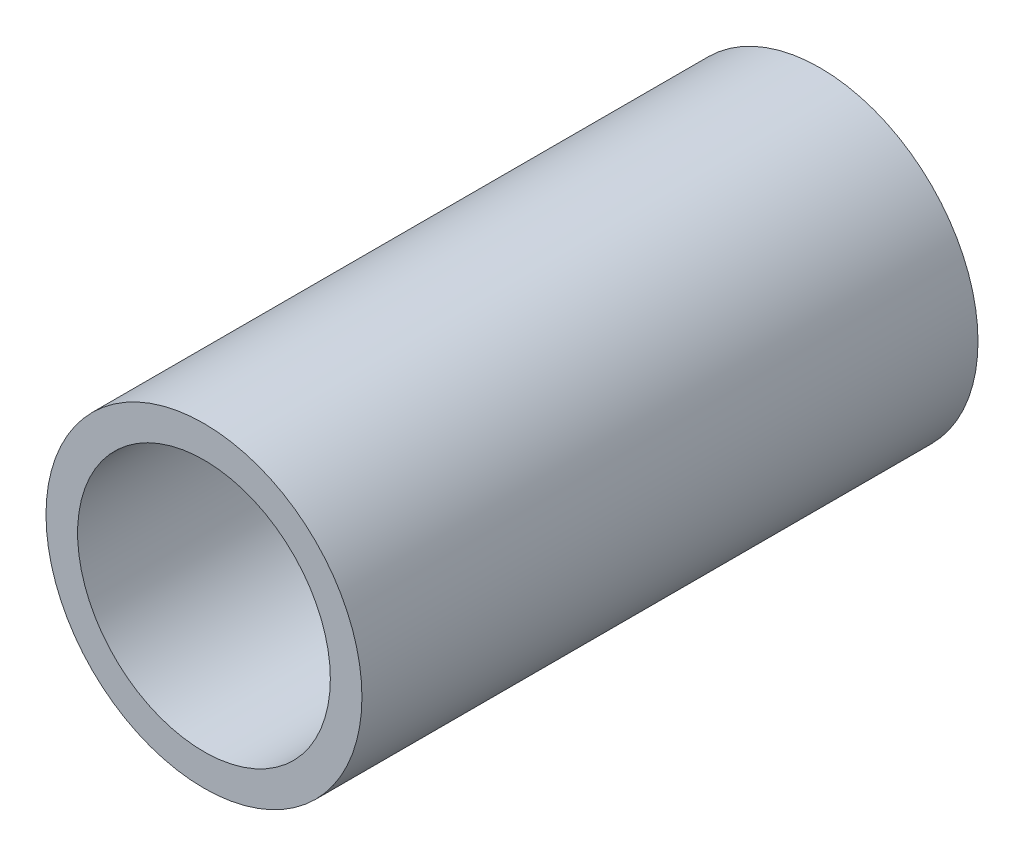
ISO-10303-21;
HEADER;
FILE_DESCRIPTION(('STEP AP214'),'2;1');
FILE_NAME('part.step','',(''),(''),'','','');
FILE_SCHEMA(('AUTOMOTIVE_DESIGN { 1 0 10303 214 1 1 1 1 }'));
ENDSEC;
DATA;
#1=APPLICATION_CONTEXT('core data for automotive mechanical design processes');
#2=APPLICATION_PROTOCOL_DEFINITION('international standard','automotive_design',2000,#1);
#3=PRODUCT_CONTEXT('',#1,'mechanical');
#4=PRODUCT('Part','Part','',(#3));
#5=PRODUCT_RELATED_PRODUCT_CATEGORY('part','',(#4));
#6=PRODUCT_DEFINITION_FORMATION('','',#4);
#7=PRODUCT_DEFINITION_CONTEXT('part definition',#1,'design');
#8=PRODUCT_DEFINITION('design','',#6,#7);
#9=PRODUCT_DEFINITION_SHAPE('','',#8);
#10=(LENGTH_UNIT() NAMED_UNIT(*) SI_UNIT(.MILLI.,.METRE.));
#11=(NAMED_UNIT(*) PLANE_ANGLE_UNIT() SI_UNIT($,.RADIAN.));
#12=(NAMED_UNIT(*) SI_UNIT($,.STERADIAN.) SOLID_ANGLE_UNIT());
#13=UNCERTAINTY_MEASURE_WITH_UNIT(LENGTH_MEASURE(1.E-05),#10,'distance_accuracy_value','');
#14=(GEOMETRIC_REPRESENTATION_CONTEXT(3) GLOBAL_UNCERTAINTY_ASSIGNED_CONTEXT((#13)) GLOBAL_UNIT_ASSIGNED_CONTEXT((#10,
#11,#12)) REPRESENTATION_CONTEXT('',''));
#15=CARTESIAN_POINT('',(0.,0.,0.));
#16=DIRECTION('',(0.,0.,1.));
#17=DIRECTION('',(1.,0.,0.));
#18=AXIS2_PLACEMENT_3D('',#15,#16,#17);
#19=CARTESIAN_POINT('',(0.,0.,19.5));
#20=DIRECTION('',(0.,0.,1.));
#21=DIRECTION('',(1.,0.,0.));
#22=AXIS2_PLACEMENT_3D('',#19,#20,#21);
#23=PLANE('',#22);
#24=CARTESIAN_POINT('',(0.,0.,19.5));
#25=DIRECTION('',(0.,0.,1.));
#26=DIRECTION('',(1.,0.,0.));
#27=AXIS2_PLACEMENT_3D('',#24,#25,#26);
#28=CIRCLE('',#27,5.);
#29=CARTESIAN_POINT('',(5.,0.,19.5));
#30=VERTEX_POINT('',#29);
#31=EDGE_CURVE('E10',#30,#30,#28,.T.);
#32=ORIENTED_EDGE('',*,*,#31,.T.);
#33=EDGE_LOOP('',(#32));
#34=FACE_BOUND('',#33,.T.);
#35=CARTESIAN_POINT('',(0.,0.,19.5));
#36=DIRECTION('',(0.,0.,1.));
#37=DIRECTION('',(1.,0.,0.));
#38=AXIS2_PLACEMENT_3D('',#35,#36,#37);
#39=CIRCLE('',#38,4.);
#40=CARTESIAN_POINT('',(4.,0.,19.5));
#41=VERTEX_POINT('',#40);
#42=EDGE_CURVE('E42',#41,#41,#39,.T.);
#43=ORIENTED_EDGE('',*,*,#42,.F.);
#44=EDGE_LOOP('',(#43));
#45=FACE_BOUND('',#44,.T.);
#46=ADVANCED_FACE('F31',(#34,#45),#23,.T.);
#47=CARTESIAN_POINT('',(0.,0.,0.));
#48=DIRECTION('',(0.,0.,1.));
#49=DIRECTION('',(1.,0.,0.));
#50=AXIS2_PLACEMENT_3D('',#47,#48,#49);
#51=PLANE('',#50);
#52=CARTESIAN_POINT('',(0.,0.,0.));
#53=DIRECTION('',(0.,0.,1.));
#54=DIRECTION('',(1.,0.,0.));
#55=AXIS2_PLACEMENT_3D('',#52,#53,#54);
#56=CIRCLE('',#55,5.);
#57=CARTESIAN_POINT('',(5.,0.,0.));
#58=VERTEX_POINT('',#57);
#59=EDGE_CURVE('E35',#58,#58,#56,.T.);
#60=ORIENTED_EDGE('',*,*,#59,.F.);
#61=EDGE_LOOP('',(#60));
#62=FACE_BOUND('',#61,.T.);
#63=CARTESIAN_POINT('',(0.,0.,0.));
#64=DIRECTION('',(0.,0.,1.));
#65=DIRECTION('',(1.,0.,0.));
#66=AXIS2_PLACEMENT_3D('',#63,#64,#65);
#67=CIRCLE('',#66,4.);
#68=CARTESIAN_POINT('',(4.,0.,0.));
#69=VERTEX_POINT('',#68);
#70=EDGE_CURVE('E44',#69,#69,#67,.T.);
#71=ORIENTED_EDGE('',*,*,#70,.T.);
#72=EDGE_LOOP('',(#71));
#73=FACE_BOUND('',#72,.T.);
#74=ADVANCED_FACE('F54',(#62,#73),#51,.F.);
#75=CARTESIAN_POINT('',(0.,0.,19.5));
#76=DIRECTION('',(0.,0.,-1.));
#77=DIRECTION('',(-1.,0.,0.));
#78=AXIS2_PLACEMENT_3D('',#75,#76,#77);
#79=CYLINDRICAL_SURFACE('',#78,5.);
#80=ORIENTED_EDGE('',*,*,#31,.F.);
#81=EDGE_LOOP('',(#80));
#82=FACE_BOUND('',#81,.T.);
#83=ORIENTED_EDGE('',*,*,#59,.T.);
#84=EDGE_LOOP('',(#83));
#85=FACE_BOUND('',#84,.T.);
#86=ADVANCED_FACE('F33',(#82,#85),#79,.T.);
#87=CARTESIAN_POINT('',(0.,0.,19.5));
#88=DIRECTION('',(0.,0.,-1.));
#89=DIRECTION('',(-1.,0.,0.));
#90=AXIS2_PLACEMENT_3D('',#87,#88,#89);
#91=CYLINDRICAL_SURFACE('',#90,4.);
#92=ORIENTED_EDGE('',*,*,#42,.T.);
#93=EDGE_LOOP('',(#92));
#94=FACE_BOUND('',#93,.T.);
#95=ORIENTED_EDGE('',*,*,#70,.F.);
#96=EDGE_LOOP('',(#95));
#97=FACE_BOUND('',#96,.T.);
#98=ADVANCED_FACE('F50',(#94,#97),#91,.F.);
#99=CLOSED_SHELL('',(#46,#74,#86,#98));
#100=MANIFOLD_SOLID_BREP('B2',#99);
#101=ADVANCED_BREP_SHAPE_REPRESENTATION('',(#18,#100),#14);
#102=SHAPE_DEFINITION_REPRESENTATION(#9,#101);
ENDSEC;
END-ISO-10303-21;
